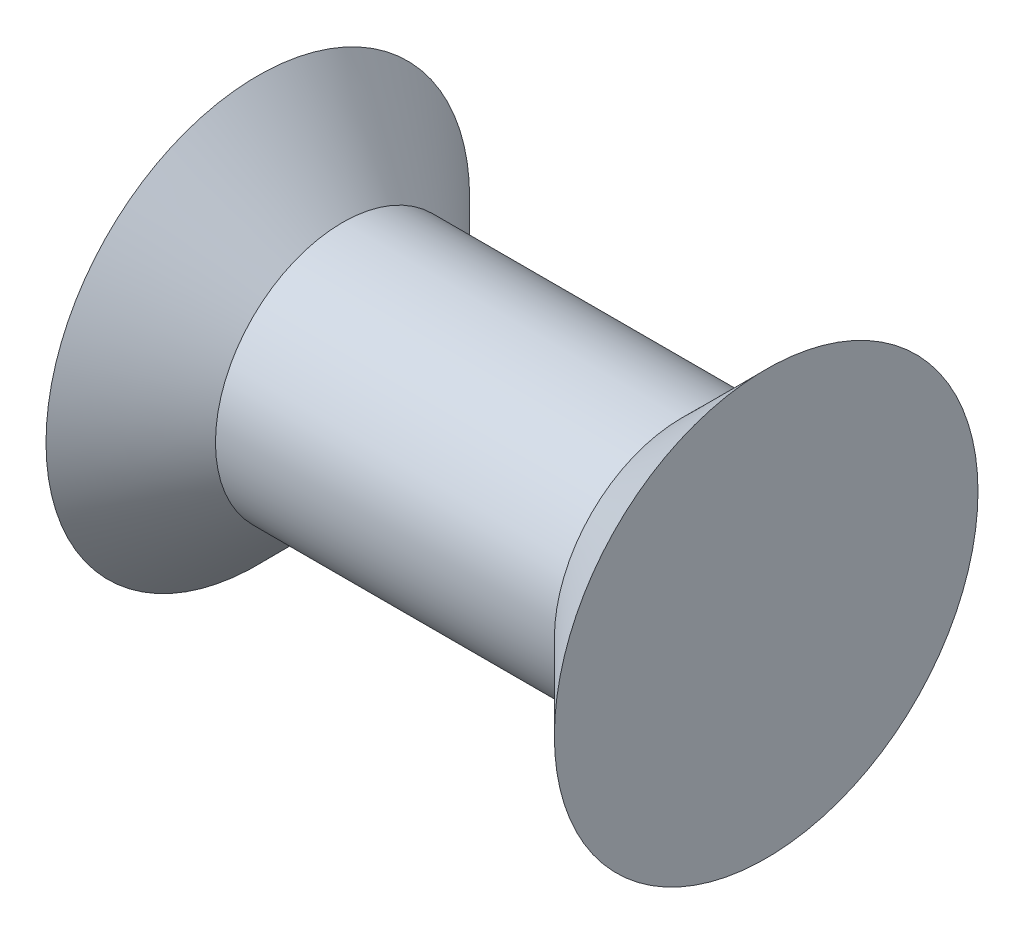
from build123d import *


with BuildPart() as part:
    # Esquisse1 → R_volution1 (revolve)
    with BuildSketch(Plane.XY, mode=Mode.PRIVATE) as r_volution1_sk:
        Polygon((-6.126940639, 40.553564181), (1.873059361, 40.553564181), (3.873059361, 42.553564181), (3.873059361, 37.553564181), (-8.126940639, 37.553564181), (-8.126940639, 42.553564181), align=None)
    revolve(r_volution1_sk.sketch.rotate(Axis((-15.350887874, 37.553564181, 0), (1, 0, 0)), 90), axis=Axis((-15.350887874, 37.553564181, 0), (1, 0, 0)))


solid = part.part
